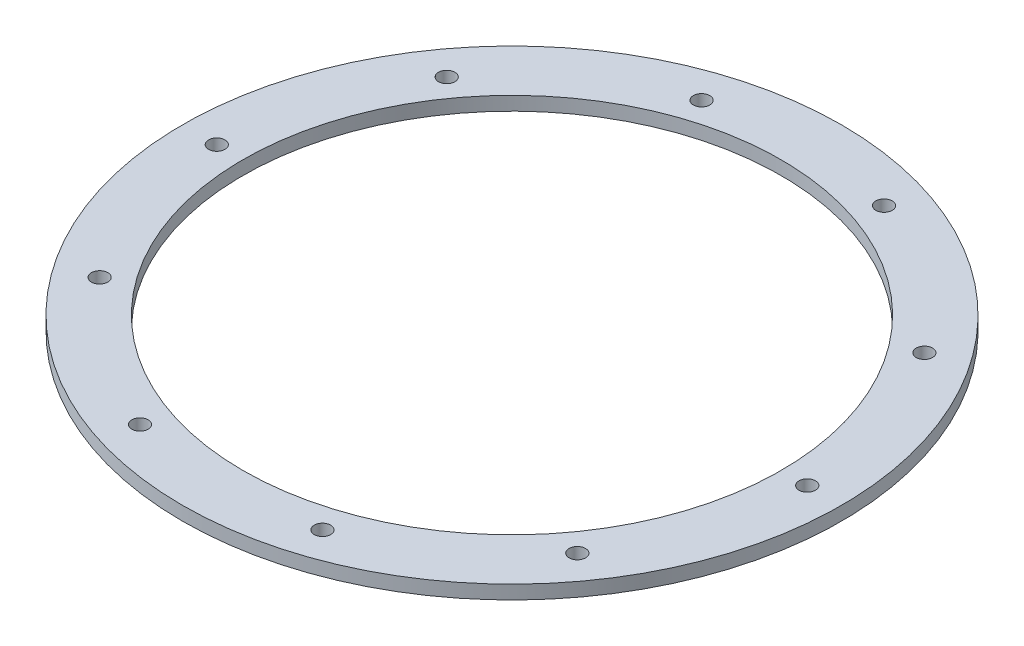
from build123d import *

# Parameters (mm, degrees)
SKETCH1_R             = 76.2
SKETCH1_R_2           = 62.23
EXTRUDE1_DEPTH        = 3.175
F_6_CLEARANCE_HOLE1_D = 3.7973
CIRPATTERN1_COUNT     = 10


with BuildPart() as part:
    # Sketch1 → Extrude1 (new body)
    with BuildSketch(Plane(origin=(0, 0, 0), x_dir=(1, 0, 0), z_dir=(0, 1, 0))):
        with Locations(Location((0, 0, 0), (0, 0, 270))):
            Circle(SKETCH1_R)
        with Locations(Location((0, 0, 0), (0, 0, 270))):
            Circle(SKETCH1_R_2, mode=Mode.SUBTRACT)
    extrude(amount=EXTRUDE1_DEPTH)

    # 6 Clearance Hole1 (through all)
    with Locations(Plane(origin=(0, 3.175, 0), x_dir=(-1, 0, 0), z_dir=(0, 1, 0))):
        with Locations((-68.2625, 0)):
            f_6_clearance_hole1 = Hole(F_6_CLEARANCE_HOLE1_D / 2)

    # CirPattern1: 6 Clearance Hole1 ×10 about axis
    cirpattern1_axis = Axis((0, 0, 0), (0, 1, 0))
    for i in range(1, CIRPATTERN1_COUNT):
        add(f_6_clearance_hole1.rotate(cirpattern1_axis, i * 360 / CIRPATTERN1_COUNT), mode=Mode.SUBTRACT)


solid = part.part
